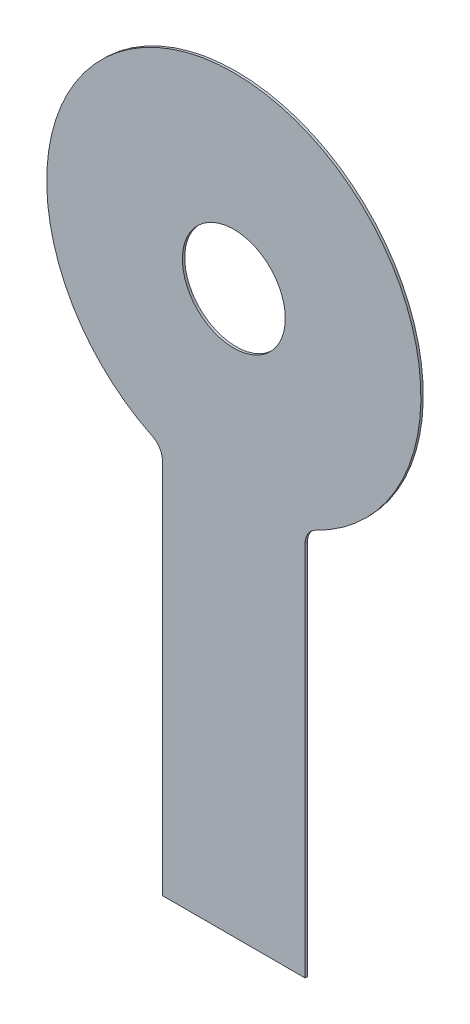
ISO-10303-21;
HEADER;
FILE_DESCRIPTION(('STEP AP214'),'2;1');
FILE_NAME('part.step','',(''),(''),'','','');
FILE_SCHEMA(('AUTOMOTIVE_DESIGN { 1 0 10303 214 1 1 1 1 }'));
ENDSEC;
DATA;
#1=APPLICATION_CONTEXT('core data for automotive mechanical design processes');
#2=APPLICATION_PROTOCOL_DEFINITION('international standard','automotive_design',2000,#1);
#3=PRODUCT_CONTEXT('',#1,'mechanical');
#4=PRODUCT('Part','Part','',(#3));
#5=PRODUCT_RELATED_PRODUCT_CATEGORY('part','',(#4));
#6=PRODUCT_DEFINITION_FORMATION('','',#4);
#7=PRODUCT_DEFINITION_CONTEXT('part definition',#1,'design');
#8=PRODUCT_DEFINITION('design','',#6,#7);
#9=PRODUCT_DEFINITION_SHAPE('','',#8);
#10=(LENGTH_UNIT() NAMED_UNIT(*) SI_UNIT(.MILLI.,.METRE.));
#11=(NAMED_UNIT(*) PLANE_ANGLE_UNIT() SI_UNIT($,.RADIAN.));
#12=(NAMED_UNIT(*) SI_UNIT($,.STERADIAN.) SOLID_ANGLE_UNIT());
#13=UNCERTAINTY_MEASURE_WITH_UNIT(LENGTH_MEASURE(1.E-05),#10,'distance_accuracy_value','');
#14=(GEOMETRIC_REPRESENTATION_CONTEXT(3) GLOBAL_UNCERTAINTY_ASSIGNED_CONTEXT((#13)) GLOBAL_UNIT_ASSIGNED_CONTEXT((#10,
#11,#12)) REPRESENTATION_CONTEXT('',''));
#15=CARTESIAN_POINT('',(0.,0.,0.));
#16=DIRECTION('',(0.,0.,1.));
#17=DIRECTION('',(1.,0.,0.));
#18=AXIS2_PLACEMENT_3D('',#15,#16,#17);
#19=CARTESIAN_POINT('',(0.,0.,0.127));
#20=DIRECTION('',(0.,0.,1.));
#21=DIRECTION('',(1.,0.,0.));
#22=AXIS2_PLACEMENT_3D('',#19,#20,#21);
#23=PLANE('',#22);
#24=CARTESIAN_POINT('',(0.,0.,0.127));
#25=DIRECTION('',(0.,0.,1.));
#26=DIRECTION('',(1.,0.,0.));
#27=AXIS2_PLACEMENT_3D('',#24,#25,#26);
#28=CIRCLE('',#27,10.);
#29=CARTESIAN_POINT('',(4.37272727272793,-8.99328950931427,0.127));
#30=VERTEX_POINT('',#29);
#31=CARTESIAN_POINT('',(-4.37272727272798,-8.99328950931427,0.127));
#32=VERTEX_POINT('',#31);
#33=EDGE_CURVE('E146',#30,#32,#28,.T.);
#34=ORIENTED_EDGE('',*,*,#33,.T.);
#35=CARTESIAN_POINT('',(-4.81000000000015,-9.89261846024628,0.127));
#36=DIRECTION('',(0.,0.,-1.));
#37=DIRECTION('',(1.,0.,0.));
#38=AXIS2_PLACEMENT_3D('',#35,#36,#37);
#39=CIRCLE('',#38,1.00000000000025);
#40=CARTESIAN_POINT('',(-3.80999999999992,-9.89261846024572,0.127));
#41=VERTEX_POINT('',#40);
#42=EDGE_CURVE('E93',#32,#41,#39,.T.);
#43=ORIENTED_EDGE('',*,*,#42,.T.);
#44=DIRECTION('',(0.,-1.,0.));
#45=VECTOR('',#44,1.);
#46=CARTESIAN_POINT('',(-3.80999999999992,-9.89261846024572,0.127));
#47=LINE('',#46,#45);
#48=CARTESIAN_POINT('',(-3.81000000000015,-29.9997503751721,0.127));
#49=VERTEX_POINT('',#48);
#50=EDGE_CURVE('E106',#41,#49,#47,.T.);
#51=ORIENTED_EDGE('',*,*,#50,.T.);
#52=DIRECTION('',(1.,0.,0.));
#53=VECTOR('',#52,1.);
#54=CARTESIAN_POINT('',(-3.81000000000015,-29.9997503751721,0.127));
#55=LINE('',#54,#53);
#56=CARTESIAN_POINT('',(3.80999999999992,-29.9997503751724,0.127));
#57=VERTEX_POINT('',#56);
#58=EDGE_CURVE('E100',#49,#57,#55,.T.);
#59=ORIENTED_EDGE('',*,*,#58,.T.);
#60=DIRECTION('',(0.,1.,0.));
#61=VECTOR('',#60,1.);
#62=CARTESIAN_POINT('',(3.80999999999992,-29.9997503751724,0.127));
#63=LINE('',#62,#61);
#64=CARTESIAN_POINT('',(3.80999999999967,-9.89261846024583,0.127));
#65=VERTEX_POINT('',#64);
#66=EDGE_CURVE('E104',#57,#65,#63,.T.);
#67=ORIENTED_EDGE('',*,*,#66,.T.);
#68=CARTESIAN_POINT('',(4.81000000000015,-9.8926184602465,0.127));
#69=DIRECTION('',(0.,0.,-1.));
#70=DIRECTION('',(1.,0.,0.));
#71=AXIS2_PLACEMENT_3D('',#68,#69,#70);
#72=CIRCLE('',#71,1.00000000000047);
#73=EDGE_CURVE('E56',#65,#30,#72,.T.);
#74=ORIENTED_EDGE('',*,*,#73,.T.);
#75=EDGE_LOOP('',(#34,#43,#51,#59,#67,#74));
#76=FACE_BOUND('',#75,.T.);
#77=CARTESIAN_POINT('',(0.,0.,0.127));
#78=DIRECTION('',(0.,0.,1.));
#79=DIRECTION('',(1.,0.,0.));
#80=AXIS2_PLACEMENT_3D('',#77,#78,#79);
#81=CIRCLE('',#80,2.74999999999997);
#82=CARTESIAN_POINT('',(2.74999999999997,0.,0.127));
#83=VERTEX_POINT('',#82);
#84=EDGE_CURVE('E134',#83,#83,#81,.T.);
#85=ORIENTED_EDGE('',*,*,#84,.F.);
#86=EDGE_LOOP('',(#85));
#87=FACE_BOUND('',#86,.T.);
#88=ADVANCED_FACE('F38',(#76,#87),#23,.T.);
#89=CARTESIAN_POINT('',(0.,0.,0.));
#90=DIRECTION('',(0.,0.,1.));
#91=DIRECTION('',(1.,0.,0.));
#92=AXIS2_PLACEMENT_3D('',#89,#90,#91);
#93=PLANE('',#92);
#94=CARTESIAN_POINT('',(0.,0.,0.));
#95=DIRECTION('',(0.,0.,1.));
#96=DIRECTION('',(1.,0.,0.));
#97=AXIS2_PLACEMENT_3D('',#94,#95,#96);
#98=CIRCLE('',#97,10.);
#99=CARTESIAN_POINT('',(4.37272727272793,-8.99328950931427,0.));
#100=VERTEX_POINT('',#99);
#101=CARTESIAN_POINT('',(-4.37272727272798,-8.99328950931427,0.));
#102=VERTEX_POINT('',#101);
#103=EDGE_CURVE('E129',#100,#102,#98,.T.);
#104=ORIENTED_EDGE('',*,*,#103,.F.);
#105=CARTESIAN_POINT('',(4.81000000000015,-9.8926184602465,0.));
#106=DIRECTION('',(0.,0.,-1.));
#107=DIRECTION('',(1.,0.,0.));
#108=AXIS2_PLACEMENT_3D('',#105,#106,#107);
#109=CIRCLE('',#108,1.00000000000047);
#110=CARTESIAN_POINT('',(3.80999999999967,-9.89261846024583,0.));
#111=VERTEX_POINT('',#110);
#112=EDGE_CURVE('E85',#111,#100,#109,.T.);
#113=ORIENTED_EDGE('',*,*,#112,.F.);
#114=DIRECTION('',(0.,1.,0.));
#115=VECTOR('',#114,1.);
#116=CARTESIAN_POINT('',(3.80999999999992,-29.9997503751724,0.));
#117=LINE('',#116,#115);
#118=CARTESIAN_POINT('',(3.80999999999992,-29.9997503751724,0.));
#119=VERTEX_POINT('',#118);
#120=EDGE_CURVE('E79',#119,#111,#117,.T.);
#121=ORIENTED_EDGE('',*,*,#120,.F.);
#122=DIRECTION('',(1.,0.,0.));
#123=VECTOR('',#122,1.);
#124=CARTESIAN_POINT('',(-3.81000000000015,-29.9997503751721,0.));
#125=LINE('',#124,#123);
#126=CARTESIAN_POINT('',(-3.81000000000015,-29.9997503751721,0.));
#127=VERTEX_POINT('',#126);
#128=EDGE_CURVE('E115',#127,#119,#125,.T.);
#129=ORIENTED_EDGE('',*,*,#128,.F.);
#130=DIRECTION('',(0.,-1.,0.));
#131=VECTOR('',#130,1.);
#132=CARTESIAN_POINT('',(-3.80999999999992,-9.89261846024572,0.));
#133=LINE('',#132,#131);
#134=CARTESIAN_POINT('',(-3.80999999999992,-9.89261846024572,0.));
#135=VERTEX_POINT('',#134);
#136=EDGE_CURVE('E137',#135,#127,#133,.T.);
#137=ORIENTED_EDGE('',*,*,#136,.F.);
#138=CARTESIAN_POINT('',(-4.81000000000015,-9.89261846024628,0.));
#139=DIRECTION('',(0.,0.,-1.));
#140=DIRECTION('',(1.,0.,0.));
#141=AXIS2_PLACEMENT_3D('',#138,#139,#140);
#142=CIRCLE('',#141,1.00000000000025);
#143=EDGE_CURVE('E133',#102,#135,#142,.T.);
#144=ORIENTED_EDGE('',*,*,#143,.F.);
#145=EDGE_LOOP('',(#104,#113,#121,#129,#137,#144));
#146=FACE_BOUND('',#145,.T.);
#147=CARTESIAN_POINT('',(0.,0.,0.));
#148=DIRECTION('',(0.,0.,1.));
#149=DIRECTION('',(1.,0.,0.));
#150=AXIS2_PLACEMENT_3D('',#147,#148,#149);
#151=CIRCLE('',#150,2.74999999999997);
#152=CARTESIAN_POINT('',(2.74999999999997,0.,0.));
#153=VERTEX_POINT('',#152);
#154=EDGE_CURVE('E253',#153,#153,#151,.T.);
#155=ORIENTED_EDGE('',*,*,#154,.T.);
#156=EDGE_LOOP('',(#155));
#157=FACE_BOUND('',#156,.T.);
#158=ADVANCED_FACE('F159',(#146,#157),#93,.F.);
#159=CARTESIAN_POINT('',(0.,0.,0.127));
#160=DIRECTION('',(0.,0.,-1.));
#161=DIRECTION('',(-1.,0.,0.));
#162=AXIS2_PLACEMENT_3D('',#159,#160,#161);
#163=CYLINDRICAL_SURFACE('',#162,10.);
#164=ORIENTED_EDGE('',*,*,#103,.T.);
#165=DIRECTION('',(0.,0.,-1.));
#166=VECTOR('',#165,1.);
#167=CARTESIAN_POINT('',(-4.37272727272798,-8.99328950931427,0.127));
#168=LINE('',#167,#166);
#169=EDGE_CURVE('E11',#32,#102,#168,.T.);
#170=ORIENTED_EDGE('',*,*,#169,.F.);
#171=ORIENTED_EDGE('',*,*,#33,.F.);
#172=DIRECTION('',(0.,0.,-1.));
#173=VECTOR('',#172,1.);
#174=CARTESIAN_POINT('',(4.37272727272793,-8.99328950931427,0.127));
#175=LINE('',#174,#173);
#176=EDGE_CURVE('E125',#30,#100,#175,.T.);
#177=ORIENTED_EDGE('',*,*,#176,.T.);
#178=EDGE_LOOP('',(#164,#170,#171,#177));
#179=FACE_BOUND('',#178,.T.);
#180=ADVANCED_FACE('F40',(#179),#163,.T.);
#181=CARTESIAN_POINT('',(-4.81000000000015,-9.89261846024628,0.127));
#182=DIRECTION('',(0.,0.,-1.));
#183=DIRECTION('',(-1.,0.,0.));
#184=AXIS2_PLACEMENT_3D('',#181,#182,#183);
#185=CYLINDRICAL_SURFACE('',#184,1.00000000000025);
#186=ORIENTED_EDGE('',*,*,#143,.T.);
#187=DIRECTION('',(0.,0.,-1.));
#188=VECTOR('',#187,1.);
#189=CARTESIAN_POINT('',(-3.80999999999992,-9.89261846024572,0.127));
#190=LINE('',#189,#188);
#191=EDGE_CURVE('E48',#41,#135,#190,.T.);
#192=ORIENTED_EDGE('',*,*,#191,.F.);
#193=ORIENTED_EDGE('',*,*,#42,.F.);
#194=ORIENTED_EDGE('',*,*,#169,.T.);
#195=EDGE_LOOP('',(#186,#192,#193,#194));
#196=FACE_BOUND('',#195,.T.);
#197=ADVANCED_FACE('F184',(#196),#185,.F.);
#198=CARTESIAN_POINT('',(-3.80999999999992,-9.89261846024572,0.127));
#199=DIRECTION('',(1.,0.,0.));
#200=DIRECTION('',(0.,1.,0.));
#201=AXIS2_PLACEMENT_3D('',#198,#199,#200);
#202=PLANE('',#201);
#203=ORIENTED_EDGE('',*,*,#136,.T.);
#204=DIRECTION('',(0.,0.,-1.));
#205=VECTOR('',#204,1.);
#206=CARTESIAN_POINT('',(-3.81000000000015,-29.9997503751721,0.127));
#207=LINE('',#206,#205);
#208=EDGE_CURVE('E117',#49,#127,#207,.T.);
#209=ORIENTED_EDGE('',*,*,#208,.F.);
#210=ORIENTED_EDGE('',*,*,#50,.F.);
#211=ORIENTED_EDGE('',*,*,#191,.T.);
#212=EDGE_LOOP('',(#203,#209,#210,#211));
#213=FACE_BOUND('',#212,.T.);
#214=ADVANCED_FACE('F156',(#213),#202,.F.);
#215=CARTESIAN_POINT('',(-3.81000000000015,-29.9997503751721,0.127));
#216=DIRECTION('',(0.,1.,0.));
#217=DIRECTION('',(-1.,0.,0.));
#218=AXIS2_PLACEMENT_3D('',#215,#216,#217);
#219=PLANE('',#218);
#220=ORIENTED_EDGE('',*,*,#128,.T.);
#221=DIRECTION('',(0.,0.,-1.));
#222=VECTOR('',#221,1.);
#223=CARTESIAN_POINT('',(3.80999999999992,-29.9997503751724,0.127));
#224=LINE('',#223,#222);
#225=EDGE_CURVE('E112',#57,#119,#224,.T.);
#226=ORIENTED_EDGE('',*,*,#225,.F.);
#227=ORIENTED_EDGE('',*,*,#58,.F.);
#228=ORIENTED_EDGE('',*,*,#208,.T.);
#229=EDGE_LOOP('',(#220,#226,#227,#228));
#230=FACE_BOUND('',#229,.T.);
#231=ADVANCED_FACE('F113',(#230),#219,.F.);
#232=CARTESIAN_POINT('',(3.80999999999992,-29.9997503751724,0.127));
#233=DIRECTION('',(-1.,0.,0.));
#234=DIRECTION('',(0.,-1.,0.));
#235=AXIS2_PLACEMENT_3D('',#232,#233,#234);
#236=PLANE('',#235);
#237=ORIENTED_EDGE('',*,*,#120,.T.);
#238=DIRECTION('',(0.,0.,-1.));
#239=VECTOR('',#238,1.);
#240=CARTESIAN_POINT('',(3.80999999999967,-9.89261846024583,0.127));
#241=LINE('',#240,#239);
#242=EDGE_CURVE('E118',#65,#111,#241,.T.);
#243=ORIENTED_EDGE('',*,*,#242,.F.);
#244=ORIENTED_EDGE('',*,*,#66,.F.);
#245=ORIENTED_EDGE('',*,*,#225,.T.);
#246=EDGE_LOOP('',(#237,#243,#244,#245));
#247=FACE_BOUND('',#246,.T.);
#248=ADVANCED_FACE('F120',(#247),#236,.F.);
#249=CARTESIAN_POINT('',(4.81000000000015,-9.8926184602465,0.127));
#250=DIRECTION('',(0.,0.,-1.));
#251=DIRECTION('',(-1.,0.,0.));
#252=AXIS2_PLACEMENT_3D('',#249,#250,#251);
#253=CYLINDRICAL_SURFACE('',#252,1.00000000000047);
#254=ORIENTED_EDGE('',*,*,#112,.T.);
#255=ORIENTED_EDGE('',*,*,#176,.F.);
#256=ORIENTED_EDGE('',*,*,#73,.F.);
#257=ORIENTED_EDGE('',*,*,#242,.T.);
#258=EDGE_LOOP('',(#254,#255,#256,#257));
#259=FACE_BOUND('',#258,.T.);
#260=ADVANCED_FACE('F164',(#259),#253,.F.);
#261=CARTESIAN_POINT('',(0.,0.,0.127));
#262=DIRECTION('',(0.,0.,-1.));
#263=DIRECTION('',(-1.,0.,0.));
#264=AXIS2_PLACEMENT_3D('',#261,#262,#263);
#265=CYLINDRICAL_SURFACE('',#264,2.74999999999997);
#266=ORIENTED_EDGE('',*,*,#84,.T.);
#267=EDGE_LOOP('',(#266));
#268=FACE_BOUND('',#267,.T.);
#269=ORIENTED_EDGE('',*,*,#154,.F.);
#270=EDGE_LOOP('',(#269));
#271=FACE_BOUND('',#270,.T.);
#272=ADVANCED_FACE('F166',(#268,#271),#265,.F.);
#273=CLOSED_SHELL('',(#88,#158,#180,#197,#214,#231,#248,#260,#272));
#274=MANIFOLD_SOLID_BREP('B2',#273);
#275=ADVANCED_BREP_SHAPE_REPRESENTATION('',(#18,#274),#14);
#276=SHAPE_DEFINITION_REPRESENTATION(#9,#275);
ENDSEC;
END-ISO-10303-21;
